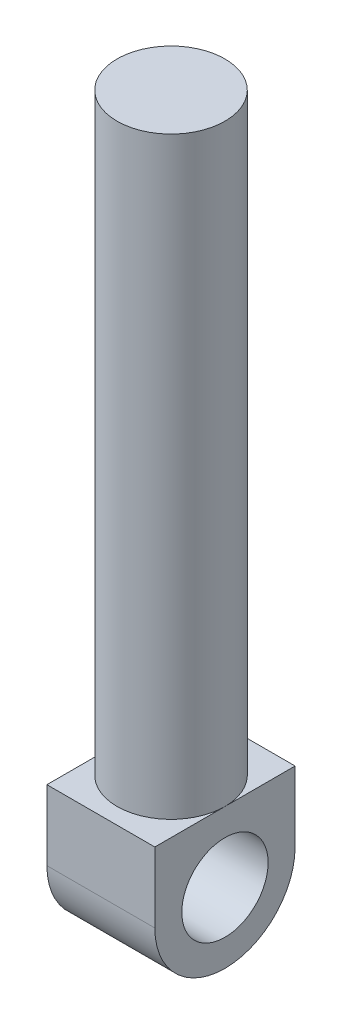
from build123d import *

# Parameters (mm, degrees)
SKETCH1_R           = 40
BOSS_EXTRUDE1_DEPTH = 50
SKETCH2_R           = 50
BOSS_EXTRUDE3_DEPTH = 550


with BuildPart() as part:
    # Sketch1 → Boss-Extrude1 (new, symmetric)
    with BuildSketch(Plane(origin=(0, 0, 0), x_dir=(0, 0, -1), z_dir=(1, 0, 0))):
        with BuildLine():
            Line((-65, 65), (-65, 0))
            ThreePointArc((-65, 0), (0, -65), (65, 0))
            Line((65, 0), (65, 65))
            Line((65, 65), (-65, 65))
        make_face()
        Circle(SKETCH1_R, mode=Mode.SUBTRACT)
    extrude(amount=BOSS_EXTRUDE1_DEPTH, both=True)


with BuildPart() as body_2:
    # Sketch2 → Boss-Extrude3 (new body)
    with BuildSketch(Plane(origin=(0, 65, 130), x_dir=(1, 0, 0), z_dir=(0, 1, 0))):
        with Locations(Location((0, 130, 0), (0, 0, 270))):
            Circle(SKETCH2_R)
    extrude(amount=BOSS_EXTRUDE3_DEPTH)


solid = Compound([part.part, body_2.part])
